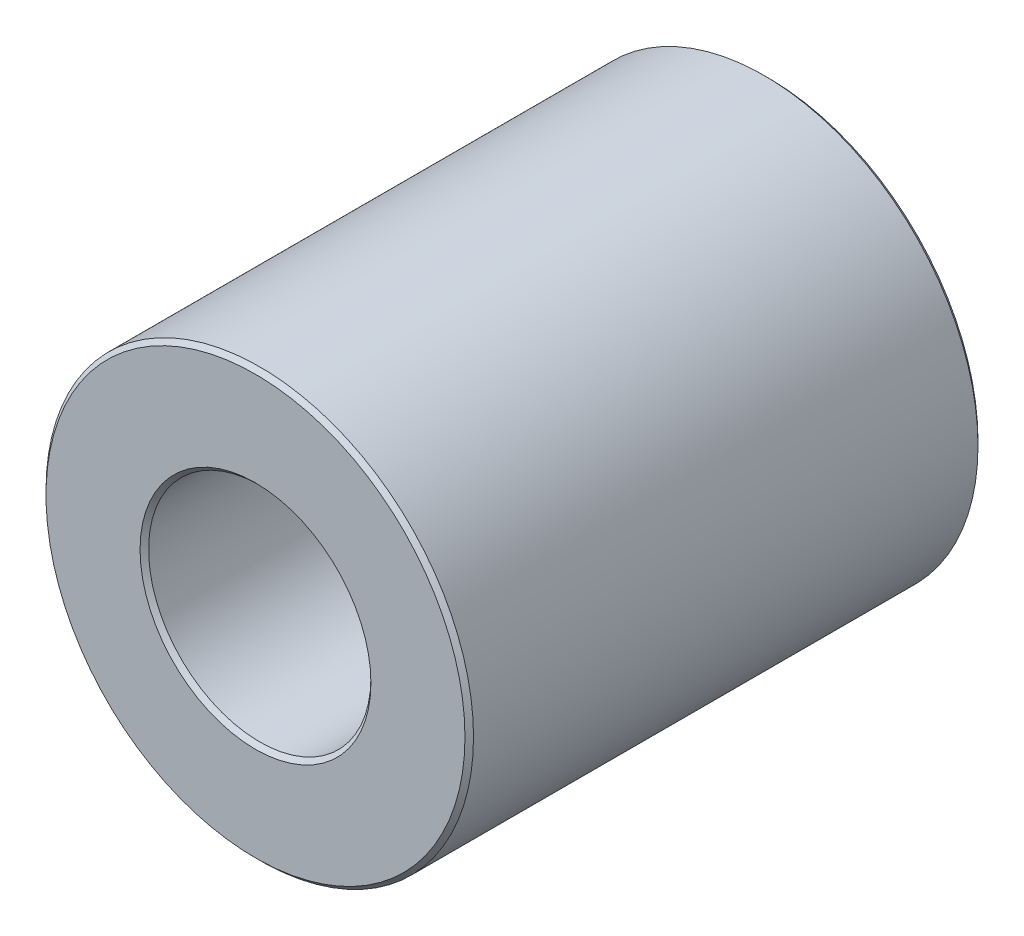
from build123d import *

# Parameters (mm, degrees)
SKETCH1_R           = 5
SKETCH1_R_2         = 2.6
BOSS_EXTRUDE2_DEPTH = 6
CHAMFER3_SIZE       = 0.1


with BuildPart() as part:
    # Sketch1 → Boss-Extrude2 (new, symmetric)
    with BuildSketch(Plane.XY):
        Circle(SKETCH1_R)
        Circle(SKETCH1_R_2, mode=Mode.SUBTRACT)
    extrude(amount=BOSS_EXTRUDE2_DEPTH, both=True)

    # Chamfer3
    chamfer3_edges = [part.edges().sort_by_distance(p)[0] for p in [
        (-5, 0, -6),
        (-5, 0, 6),
        (-2.6, 0, -6),
        (-2.6, 0, 6),
    ]]
    chamfer(chamfer3_edges, length=CHAMFER3_SIZE)


solid = part.part
